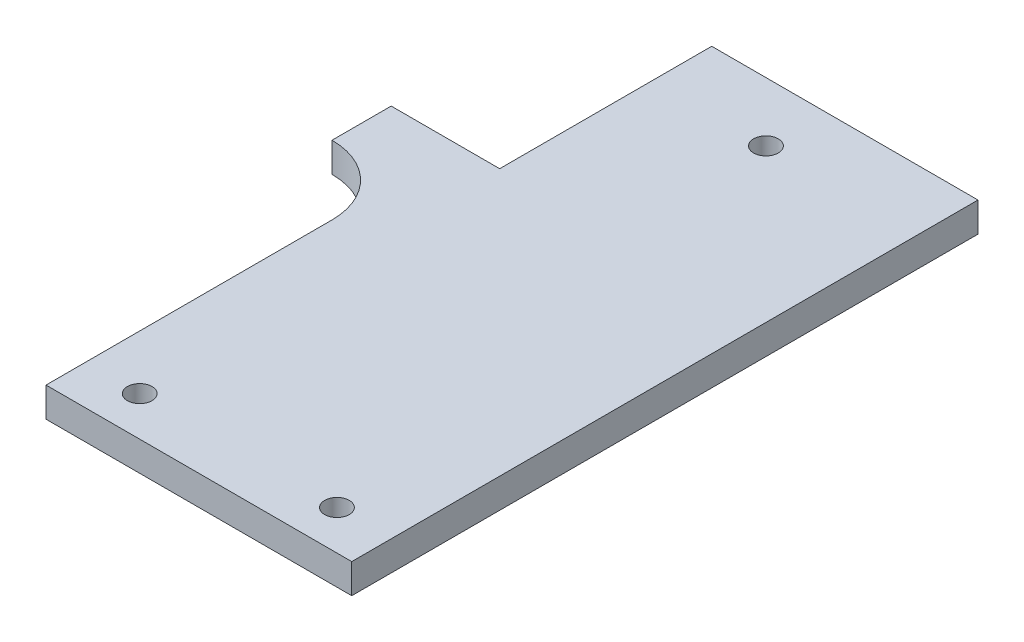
ISO-10303-21;
HEADER;
FILE_DESCRIPTION(('STEP AP214'),'2;1');
FILE_NAME('part.step','',(''),(''),'','','');
FILE_SCHEMA(('AUTOMOTIVE_DESIGN { 1 0 10303 214 1 1 1 1 }'));
ENDSEC;
DATA;
#1=APPLICATION_CONTEXT('core data for automotive mechanical design processes');
#2=APPLICATION_PROTOCOL_DEFINITION('international standard','automotive_design',2000,#1);
#3=PRODUCT_CONTEXT('',#1,'mechanical');
#4=PRODUCT('Part','Part','',(#3));
#5=PRODUCT_RELATED_PRODUCT_CATEGORY('part','',(#4));
#6=PRODUCT_DEFINITION_FORMATION('','',#4);
#7=PRODUCT_DEFINITION_CONTEXT('part definition',#1,'design');
#8=PRODUCT_DEFINITION('design','',#6,#7);
#9=PRODUCT_DEFINITION_SHAPE('','',#8);
#10=(LENGTH_UNIT() NAMED_UNIT(*) SI_UNIT(.MILLI.,.METRE.));
#11=(NAMED_UNIT(*) PLANE_ANGLE_UNIT() SI_UNIT($,.RADIAN.));
#12=(NAMED_UNIT(*) SI_UNIT($,.STERADIAN.) SOLID_ANGLE_UNIT());
#13=UNCERTAINTY_MEASURE_WITH_UNIT(LENGTH_MEASURE(1.E-05),#10,'distance_accuracy_value','');
#14=(GEOMETRIC_REPRESENTATION_CONTEXT(3) GLOBAL_UNCERTAINTY_ASSIGNED_CONTEXT((#13)) GLOBAL_UNIT_ASSIGNED_CONTEXT((#10,
#11,#12)) REPRESENTATION_CONTEXT('',''));
#15=CARTESIAN_POINT('',(0.,0.,0.));
#16=DIRECTION('',(0.,0.,1.));
#17=DIRECTION('',(1.,0.,0.));
#18=AXIS2_PLACEMENT_3D('',#15,#16,#17);
#19=CARTESIAN_POINT('',(0.,6.,0.));
#20=DIRECTION('',(1.,0.,0.));
#21=DIRECTION('',(0.,0.,-1.));
#22=AXIS2_PLACEMENT_3D('',#19,#20,#21);
#23=PLANE('',#22);
#24=DIRECTION('',(0.,0.,1.));
#25=VECTOR('',#24,1.);
#26=CARTESIAN_POINT('',(0.,0.,0.));
#27=LINE('',#26,#25);
#28=CARTESIAN_POINT('',(0.,0.,-58.));
#29=VERTEX_POINT('',#28);
#30=CARTESIAN_POINT('',(0.,0.,0.));
#31=VERTEX_POINT('',#30);
#32=EDGE_CURVE('E126',#29,#31,#27,.T.);
#33=ORIENTED_EDGE('',*,*,#32,.T.);
#34=DIRECTION('',(0.,-1.,0.));
#35=VECTOR('',#34,1.);
#36=CARTESIAN_POINT('',(0.,6.,0.));
#37=LINE('',#36,#35);
#38=CARTESIAN_POINT('',(0.,6.,0.));
#39=VERTEX_POINT('',#38);
#40=EDGE_CURVE('E11',#39,#31,#37,.T.);
#41=ORIENTED_EDGE('',*,*,#40,.F.);
#42=DIRECTION('',(0.,0.,1.));
#43=VECTOR('',#42,1.);
#44=CARTESIAN_POINT('',(0.,6.,0.));
#45=LINE('',#44,#43);
#46=CARTESIAN_POINT('',(0.,6.,-58.));
#47=VERTEX_POINT('',#46);
#48=EDGE_CURVE('E141',#47,#39,#45,.T.);
#49=ORIENTED_EDGE('',*,*,#48,.F.);
#50=DIRECTION('',(0.,-1.,0.));
#51=VECTOR('',#50,1.);
#52=CARTESIAN_POINT('',(0.,6.,-58.));
#53=LINE('',#52,#51);
#54=EDGE_CURVE('E122',#47,#29,#53,.T.);
#55=ORIENTED_EDGE('',*,*,#54,.T.);
#56=EDGE_LOOP('',(#33,#41,#49,#55));
#57=FACE_BOUND('',#56,.T.);
#58=ADVANCED_FACE('F30',(#57),#23,.F.);
#59=CARTESIAN_POINT('',(0.,6.,0.));
#60=DIRECTION('',(0.,0.,-1.));
#61=DIRECTION('',(-1.,0.,0.));
#62=AXIS2_PLACEMENT_3D('',#59,#60,#61);
#63=PLANE('',#62);
#64=DIRECTION('',(1.,0.,0.));
#65=VECTOR('',#64,1.);
#66=CARTESIAN_POINT('',(0.,0.,0.));
#67=LINE('',#66,#65);
#68=CARTESIAN_POINT('',(62.,0.,0.));
#69=VERTEX_POINT('',#68);
#70=EDGE_CURVE('E129',#31,#69,#67,.T.);
#71=ORIENTED_EDGE('',*,*,#70,.T.);
#72=DIRECTION('',(0.,-1.,0.));
#73=VECTOR('',#72,1.);
#74=CARTESIAN_POINT('',(62.,6.,0.));
#75=LINE('',#74,#73);
#76=CARTESIAN_POINT('',(62.,6.,0.));
#77=VERTEX_POINT('',#76);
#78=EDGE_CURVE('E38',#77,#69,#75,.T.);
#79=ORIENTED_EDGE('',*,*,#78,.F.);
#80=DIRECTION('',(1.,0.,0.));
#81=VECTOR('',#80,1.);
#82=CARTESIAN_POINT('',(0.,6.,0.));
#83=LINE('',#82,#81);
#84=EDGE_CURVE('E89',#39,#77,#83,.T.);
#85=ORIENTED_EDGE('',*,*,#84,.F.);
#86=ORIENTED_EDGE('',*,*,#40,.T.);
#87=EDGE_LOOP('',(#71,#79,#85,#86));
#88=FACE_BOUND('',#87,.T.);
#89=ADVANCED_FACE('F217',(#88),#63,.F.);
#90=CARTESIAN_POINT('',(62.,6.,0.));
#91=DIRECTION('',(-1.,0.,0.));
#92=DIRECTION('',(0.,0.,1.));
#93=AXIS2_PLACEMENT_3D('',#90,#91,#92);
#94=PLANE('',#93);
#95=DIRECTION('',(0.,0.,-1.));
#96=VECTOR('',#95,1.);
#97=CARTESIAN_POINT('',(62.,0.,0.));
#98=LINE('',#97,#96);
#99=CARTESIAN_POINT('',(62.,0.,-127.));
#100=VERTEX_POINT('',#99);
#101=EDGE_CURVE('E132',#69,#100,#98,.T.);
#102=ORIENTED_EDGE('',*,*,#101,.T.);
#103=DIRECTION('',(0.,-1.,0.));
#104=VECTOR('',#103,1.);
#105=CARTESIAN_POINT('',(62.,6.,-127.));
#106=LINE('',#105,#104);
#107=CARTESIAN_POINT('',(62.,6.,-127.));
#108=VERTEX_POINT('',#107);
#109=EDGE_CURVE('E148',#108,#100,#106,.T.);
#110=ORIENTED_EDGE('',*,*,#109,.F.);
#111=DIRECTION('',(0.,0.,-1.));
#112=VECTOR('',#111,1.);
#113=CARTESIAN_POINT('',(62.,6.,0.));
#114=LINE('',#113,#112);
#115=EDGE_CURVE('E156',#77,#108,#114,.T.);
#116=ORIENTED_EDGE('',*,*,#115,.F.);
#117=ORIENTED_EDGE('',*,*,#78,.T.);
#118=EDGE_LOOP('',(#102,#110,#116,#117));
#119=FACE_BOUND('',#118,.T.);
#120=ADVANCED_FACE('F154',(#119),#94,.F.);
#121=CARTESIAN_POINT('',(8.,6.,-127.));
#122=DIRECTION('',(0.,0.,1.));
#123=DIRECTION('',(1.,0.,0.));
#124=AXIS2_PLACEMENT_3D('',#121,#122,#123);
#125=PLANE('',#124);
#126=DIRECTION('',(-1.,0.,0.));
#127=VECTOR('',#126,1.);
#128=CARTESIAN_POINT('',(8.,0.,-127.));
#129=LINE('',#128,#127);
#130=CARTESIAN_POINT('',(8.,0.,-127.));
#131=VERTEX_POINT('',#130);
#132=EDGE_CURVE('E134',#100,#131,#129,.T.);
#133=ORIENTED_EDGE('',*,*,#132,.T.);
#134=DIRECTION('',(0.,-1.,0.));
#135=VECTOR('',#134,1.);
#136=CARTESIAN_POINT('',(8.,6.,-127.));
#137=LINE('',#136,#135);
#138=CARTESIAN_POINT('',(8.,6.,-127.));
#139=VERTEX_POINT('',#138);
#140=EDGE_CURVE('E145',#139,#131,#137,.T.);
#141=ORIENTED_EDGE('',*,*,#140,.F.);
#142=DIRECTION('',(-1.,0.,0.));
#143=VECTOR('',#142,1.);
#144=CARTESIAN_POINT('',(8.,6.,-127.));
#145=LINE('',#144,#143);
#146=EDGE_CURVE('E168',#108,#139,#145,.T.);
#147=ORIENTED_EDGE('',*,*,#146,.F.);
#148=ORIENTED_EDGE('',*,*,#109,.T.);
#149=EDGE_LOOP('',(#133,#141,#147,#148));
#150=FACE_BOUND('',#149,.T.);
#151=ADVANCED_FACE('F164',(#150),#125,.F.);
#152=CARTESIAN_POINT('',(8.,6.,-127.));
#153=DIRECTION('',(1.,0.,0.));
#154=DIRECTION('',(0.,0.,-1.));
#155=AXIS2_PLACEMENT_3D('',#152,#153,#154);
#156=PLANE('',#155);
#157=DIRECTION('',(0.,0.,1.));
#158=VECTOR('',#157,1.);
#159=CARTESIAN_POINT('',(8.,0.,-127.));
#160=LINE('',#159,#158);
#161=CARTESIAN_POINT('',(8.00000000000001,0.,-84.));
#162=VERTEX_POINT('',#161);
#163=EDGE_CURVE('E136',#131,#162,#160,.T.);
#164=ORIENTED_EDGE('',*,*,#163,.T.);
#165=DIRECTION('',(0.,-1.,0.));
#166=VECTOR('',#165,1.);
#167=CARTESIAN_POINT('',(8.00000000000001,6.,-84.));
#168=LINE('',#167,#166);
#169=CARTESIAN_POINT('',(8.00000000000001,6.,-84.));
#170=VERTEX_POINT('',#169);
#171=EDGE_CURVE('E117',#170,#162,#168,.T.);
#172=ORIENTED_EDGE('',*,*,#171,.F.);
#173=DIRECTION('',(0.,0.,1.));
#174=VECTOR('',#173,1.);
#175=CARTESIAN_POINT('',(8.,6.,-127.));
#176=LINE('',#175,#174);
#177=EDGE_CURVE('E108',#139,#170,#176,.T.);
#178=ORIENTED_EDGE('',*,*,#177,.F.);
#179=ORIENTED_EDGE('',*,*,#140,.T.);
#180=EDGE_LOOP('',(#164,#172,#178,#179));
#181=FACE_BOUND('',#180,.T.);
#182=ADVANCED_FACE('F167',(#181),#156,.F.);
#183=CARTESIAN_POINT('',(8.00000000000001,6.,-84.));
#184=DIRECTION('',(0.,0.,1.));
#185=DIRECTION('',(1.,0.,0.));
#186=AXIS2_PLACEMENT_3D('',#183,#184,#185);
#187=PLANE('',#186);
#188=DIRECTION('',(-1.,0.,0.));
#189=VECTOR('',#188,1.);
#190=CARTESIAN_POINT('',(8.00000000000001,0.,-84.));
#191=LINE('',#190,#189);
#192=CARTESIAN_POINT('',(-14.,0.,-84.));
#193=VERTEX_POINT('',#192);
#194=EDGE_CURVE('E116',#162,#193,#191,.T.);
#195=ORIENTED_EDGE('',*,*,#194,.T.);
#196=DIRECTION('',(0.,-1.,0.));
#197=VECTOR('',#196,1.);
#198=CARTESIAN_POINT('',(-14.,6.,-84.));
#199=LINE('',#198,#197);
#200=CARTESIAN_POINT('',(-14.,6.,-84.));
#201=VERTEX_POINT('',#200);
#202=EDGE_CURVE('E113',#201,#193,#199,.T.);
#203=ORIENTED_EDGE('',*,*,#202,.F.);
#204=DIRECTION('',(-1.,0.,0.));
#205=VECTOR('',#204,1.);
#206=CARTESIAN_POINT('',(8.00000000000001,6.,-84.));
#207=LINE('',#206,#205);
#208=EDGE_CURVE('E102',#170,#201,#207,.T.);
#209=ORIENTED_EDGE('',*,*,#208,.F.);
#210=ORIENTED_EDGE('',*,*,#171,.T.);
#211=EDGE_LOOP('',(#195,#203,#209,#210));
#212=FACE_BOUND('',#211,.T.);
#213=ADVANCED_FACE('F114',(#212),#187,.F.);
#214=CARTESIAN_POINT('',(-14.,6.,-84.));
#215=DIRECTION('',(1.,0.,0.));
#216=DIRECTION('',(0.,0.,-1.));
#217=AXIS2_PLACEMENT_3D('',#214,#215,#216);
#218=PLANE('',#217);
#219=DIRECTION('',(0.,0.,1.));
#220=VECTOR('',#219,1.);
#221=CARTESIAN_POINT('',(-14.,0.,-84.));
#222=LINE('',#221,#220);
#223=CARTESIAN_POINT('',(-14.,0.,-72.));
#224=VERTEX_POINT('',#223);
#225=EDGE_CURVE('E75',#193,#224,#222,.T.);
#226=ORIENTED_EDGE('',*,*,#225,.T.);
#227=DIRECTION('',(0.,-1.,0.));
#228=VECTOR('',#227,1.);
#229=CARTESIAN_POINT('',(-14.,6.,-72.));
#230=LINE('',#229,#228);
#231=CARTESIAN_POINT('',(-14.,6.,-72.));
#232=VERTEX_POINT('',#231);
#233=EDGE_CURVE('E118',#232,#224,#230,.T.);
#234=ORIENTED_EDGE('',*,*,#233,.F.);
#235=DIRECTION('',(0.,0.,1.));
#236=VECTOR('',#235,1.);
#237=CARTESIAN_POINT('',(-14.,6.,-84.));
#238=LINE('',#237,#236);
#239=EDGE_CURVE('E106',#201,#232,#238,.T.);
#240=ORIENTED_EDGE('',*,*,#239,.F.);
#241=ORIENTED_EDGE('',*,*,#202,.T.);
#242=EDGE_LOOP('',(#226,#234,#240,#241));
#243=FACE_BOUND('',#242,.T.);
#244=ADVANCED_FACE('F120',(#243),#218,.F.);
#245=CARTESIAN_POINT('',(-14.,6.,-58.));
#246=DIRECTION('',(0.,-1.,0.));
#247=DIRECTION('',(0.,0.,-1.));
#248=AXIS2_PLACEMENT_3D('',#245,#246,#247);
#249=CYLINDRICAL_SURFACE('',#248,14.);
#250=CARTESIAN_POINT('',(-14.,0.,-58.));
#251=DIRECTION('',(0.,-1.,0.));
#252=DIRECTION('',(0.,0.,1.));
#253=AXIS2_PLACEMENT_3D('',#250,#251,#252);
#254=CIRCLE('',#253,14.);
#255=EDGE_CURVE('E81',#224,#29,#254,.T.);
#256=ORIENTED_EDGE('',*,*,#255,.T.);
#257=ORIENTED_EDGE('',*,*,#54,.F.);
#258=CARTESIAN_POINT('',(-14.,6.,-58.));
#259=DIRECTION('',(0.,-1.,0.));
#260=DIRECTION('',(0.,0.,1.));
#261=AXIS2_PLACEMENT_3D('',#258,#259,#260);
#262=CIRCLE('',#261,14.);
#263=EDGE_CURVE('E46',#232,#47,#262,.T.);
#264=ORIENTED_EDGE('',*,*,#263,.F.);
#265=ORIENTED_EDGE('',*,*,#233,.T.);
#266=EDGE_LOOP('',(#256,#257,#264,#265));
#267=FACE_BOUND('',#266,.T.);
#268=ADVANCED_FACE('F196',(#267),#249,.F.);
#269=CARTESIAN_POINT('',(-14.,6.,-58.));
#270=DIRECTION('',(0.,1.,0.));
#271=DIRECTION('',(0.,0.,1.));
#272=AXIS2_PLACEMENT_3D('',#269,#270,#271);
#273=PLANE('',#272);
#274=CARTESIAN_POINT('',(31.,6.,-115.));
#275=DIRECTION('',(0.,1.,0.));
#276=DIRECTION('',(0.,0.,1.));
#277=AXIS2_PLACEMENT_3D('',#274,#275,#276);
#278=CIRCLE('',#277,2.49999999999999);
#279=CARTESIAN_POINT('',(31.,6.,-112.5));
#280=VERTEX_POINT('',#279);
#281=EDGE_CURVE('E188',#280,#280,#278,.T.);
#282=ORIENTED_EDGE('',*,*,#281,.F.);
#283=EDGE_LOOP('',(#282));
#284=FACE_BOUND('',#283,.T.);
#285=CARTESIAN_POINT('',(11.,6.,-8.));
#286=DIRECTION('',(0.,1.,0.));
#287=DIRECTION('',(0.,0.,1.));
#288=AXIS2_PLACEMENT_3D('',#285,#286,#287);
#289=CIRCLE('',#288,2.49999999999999);
#290=CARTESIAN_POINT('',(11.,6.,-5.50000000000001));
#291=VERTEX_POINT('',#290);
#292=EDGE_CURVE('E182',#291,#291,#289,.T.);
#293=ORIENTED_EDGE('',*,*,#292,.F.);
#294=EDGE_LOOP('',(#293));
#295=FACE_BOUND('',#294,.T.);
#296=CARTESIAN_POINT('',(51.,6.,-8.));
#297=DIRECTION('',(0.,1.,0.));
#298=DIRECTION('',(0.,0.,1.));
#299=AXIS2_PLACEMENT_3D('',#296,#297,#298);
#300=CIRCLE('',#299,2.49999999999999);
#301=CARTESIAN_POINT('',(51.,6.,-5.50000000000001));
#302=VERTEX_POINT('',#301);
#303=EDGE_CURVE('E176',#302,#302,#300,.T.);
#304=ORIENTED_EDGE('',*,*,#303,.F.);
#305=EDGE_LOOP('',(#304));
#306=FACE_BOUND('',#305,.T.);
#307=ORIENTED_EDGE('',*,*,#48,.T.);
#308=ORIENTED_EDGE('',*,*,#84,.T.);
#309=ORIENTED_EDGE('',*,*,#115,.T.);
#310=ORIENTED_EDGE('',*,*,#146,.T.);
#311=ORIENTED_EDGE('',*,*,#177,.T.);
#312=ORIENTED_EDGE('',*,*,#208,.T.);
#313=ORIENTED_EDGE('',*,*,#239,.T.);
#314=ORIENTED_EDGE('',*,*,#263,.T.);
#315=EDGE_LOOP('',(#307,#308,#309,#310,#311,#312,#313,#314));
#316=FACE_BOUND('',#315,.T.);
#317=ADVANCED_FACE('F104',(#284,#295,#306,#316),#273,.T.);
#318=CARTESIAN_POINT('',(-14.,0.,-58.));
#319=DIRECTION('',(0.,1.,0.));
#320=DIRECTION('',(0.,0.,1.));
#321=AXIS2_PLACEMENT_3D('',#318,#319,#320);
#322=PLANE('',#321);
#323=CARTESIAN_POINT('',(31.,0.,-115.));
#324=DIRECTION('',(0.,1.,0.));
#325=DIRECTION('',(0.,0.,1.));
#326=AXIS2_PLACEMENT_3D('',#323,#324,#325);
#327=CIRCLE('',#326,2.5);
#328=CARTESIAN_POINT('',(31.,0.,-112.5));
#329=VERTEX_POINT('',#328);
#330=EDGE_CURVE('E185',#329,#329,#327,.T.);
#331=ORIENTED_EDGE('',*,*,#330,.T.);
#332=EDGE_LOOP('',(#331));
#333=FACE_BOUND('',#332,.T.);
#334=CARTESIAN_POINT('',(11.,0.,-8.));
#335=DIRECTION('',(0.,1.,0.));
#336=DIRECTION('',(0.,0.,1.));
#337=AXIS2_PLACEMENT_3D('',#334,#335,#336);
#338=CIRCLE('',#337,2.5);
#339=CARTESIAN_POINT('',(11.,0.,-5.5));
#340=VERTEX_POINT('',#339);
#341=EDGE_CURVE('E179',#340,#340,#338,.T.);
#342=ORIENTED_EDGE('',*,*,#341,.T.);
#343=EDGE_LOOP('',(#342));
#344=FACE_BOUND('',#343,.T.);
#345=CARTESIAN_POINT('',(51.,0.,-8.));
#346=DIRECTION('',(0.,1.,0.));
#347=DIRECTION('',(0.,0.,1.));
#348=AXIS2_PLACEMENT_3D('',#345,#346,#347);
#349=CIRCLE('',#348,2.5);
#350=CARTESIAN_POINT('',(51.,0.,-5.5));
#351=VERTEX_POINT('',#350);
#352=EDGE_CURVE('E130',#351,#351,#349,.T.);
#353=ORIENTED_EDGE('',*,*,#352,.T.);
#354=EDGE_LOOP('',(#353));
#355=FACE_BOUND('',#354,.T.);
#356=ORIENTED_EDGE('',*,*,#32,.F.);
#357=ORIENTED_EDGE('',*,*,#255,.F.);
#358=ORIENTED_EDGE('',*,*,#225,.F.);
#359=ORIENTED_EDGE('',*,*,#194,.F.);
#360=ORIENTED_EDGE('',*,*,#163,.F.);
#361=ORIENTED_EDGE('',*,*,#132,.F.);
#362=ORIENTED_EDGE('',*,*,#101,.F.);
#363=ORIENTED_EDGE('',*,*,#70,.F.);
#364=EDGE_LOOP('',(#356,#357,#358,#359,#360,#361,#362,#363));
#365=FACE_BOUND('',#364,.T.);
#366=ADVANCED_FACE('F160',(#333,#344,#355,#365),#322,.F.);
#367=CARTESIAN_POINT('',(51.,6.,-8.));
#368=DIRECTION('',(0.,1.,0.));
#369=DIRECTION('',(0.,0.,1.));
#370=AXIS2_PLACEMENT_3D('',#367,#368,#369);
#371=CYLINDRICAL_SURFACE('',#370,2.5);
#372=ORIENTED_EDGE('',*,*,#352,.F.);
#373=EDGE_LOOP('',(#372));
#374=FACE_BOUND('',#373,.T.);
#375=ORIENTED_EDGE('',*,*,#303,.T.);
#376=EDGE_LOOP('',(#375));
#377=FACE_BOUND('',#376,.T.);
#378=ADVANCED_FACE('F202',(#374,#377),#371,.F.);
#379=CARTESIAN_POINT('',(11.,6.,-8.));
#380=DIRECTION('',(0.,1.,0.));
#381=DIRECTION('',(0.,0.,1.));
#382=AXIS2_PLACEMENT_3D('',#379,#380,#381);
#383=CYLINDRICAL_SURFACE('',#382,2.49999999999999);
#384=ORIENTED_EDGE('',*,*,#341,.F.);
#385=EDGE_LOOP('',(#384));
#386=FACE_BOUND('',#385,.T.);
#387=ORIENTED_EDGE('',*,*,#292,.T.);
#388=EDGE_LOOP('',(#387));
#389=FACE_BOUND('',#388,.T.);
#390=ADVANCED_FACE('F204',(#386,#389),#383,.F.);
#391=CARTESIAN_POINT('',(31.,6.,-115.));
#392=DIRECTION('',(0.,1.,0.));
#393=DIRECTION('',(0.,0.,1.));
#394=AXIS2_PLACEMENT_3D('',#391,#392,#393);
#395=CYLINDRICAL_SURFACE('',#394,2.5);
#396=ORIENTED_EDGE('',*,*,#330,.F.);
#397=EDGE_LOOP('',(#396));
#398=FACE_BOUND('',#397,.T.);
#399=ORIENTED_EDGE('',*,*,#281,.T.);
#400=EDGE_LOOP('',(#399));
#401=FACE_BOUND('',#400,.T.);
#402=ADVANCED_FACE('F192',(#398,#401),#395,.F.);
#403=CLOSED_SHELL('',(#58,#89,#120,#151,#182,#213,#244,#268,#317,#366,#378,#390,#402));
#404=MANIFOLD_SOLID_BREP('B2',#403);
#405=ADVANCED_BREP_SHAPE_REPRESENTATION('',(#18,#404),#14);
#406=SHAPE_DEFINITION_REPRESENTATION(#9,#405);
ENDSEC;
END-ISO-10303-21;
